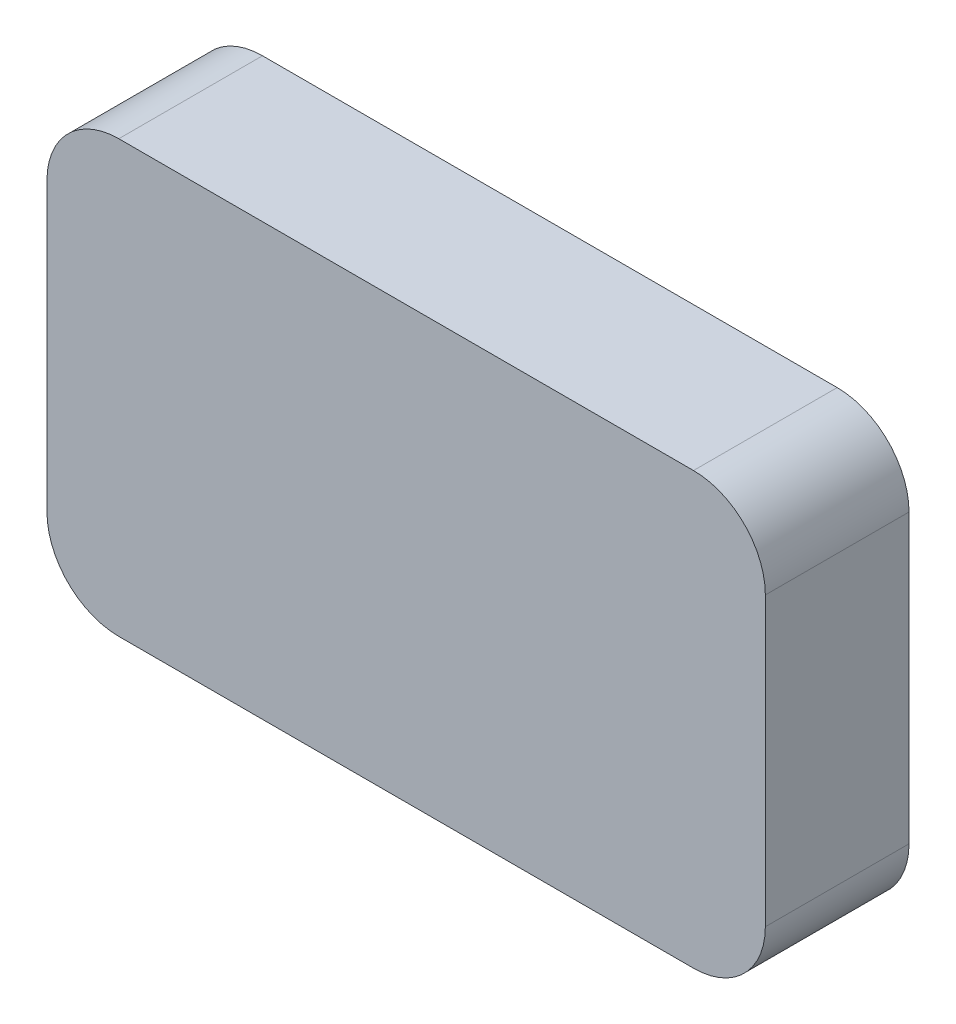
from build123d import *

# Parameters (mm, degrees)
EXTRUDE_1_DEPTH = 10


with BuildPart() as part:
    # Sketch 1 → Extrude 1 (new body)
    with BuildSketch(Plane.XY):
        with BuildLine():
            Line((-20, -15), (20, -15))
            ThreePointArc((20, -15), (23.535533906, -13.535533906), (25, -10))
            Line((25, -10), (25, 10))
            ThreePointArc((25, 10), (23.535533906, 13.535533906), (20, 15))
            Line((20, 15), (-20, 15))
            ThreePointArc((-20, 15), (-23.535533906, 13.535533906), (-25, 10))
            Line((-25, 10), (-25, -10))
            ThreePointArc((-25, -10), (-23.535533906, -13.535533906), (-20, -15))
        make_face()
    extrude(amount=EXTRUDE_1_DEPTH)


solid = part.part
